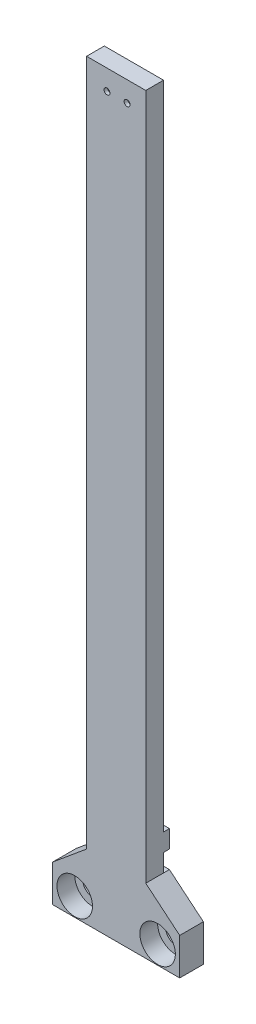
from build123d import *

# Parameters (mm, degrees)
CROQUIS1_W              = 10
CROQUIS1_H              = 125
SALIENTE_EXTRUIR1_DEPTH = 3
CROQUIS2_W              = 10
CROQUIS2_H              = 9
CROQUIS2_H_2            = 3
SALIENTE_EXTRUIR2_DEPTH = 1
CORTAR_EXTRUIR1_DEPTH   = 2.4
CROQUIS4_R              = 0.5
CORTAR_EXTRUIR2_DEPTH   = 4
SALIENTE_EXTRUIR3_DEPTH = 4
CROQUIS9_W              = 21.4673268
CROQUIS9_H              = 2
SALIENTE_EXTRUIR4_DEPTH = 4
CROQUIS7_R              = 3
CORTAR_EXTRUIR4_DEPTH   = 3
CROQUIS8_R              = 1.625
CORTAR_EXTRUIR5_DEPTH   = 6


with BuildPart() as part:
    # Croquis1 → Saliente-Extruir1 (new body)
    with BuildSketch(Plane.XY):
        with Locations((0, -52.820689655)):
            Rectangle(CROQUIS1_W, CROQUIS1_H)
    extrude(amount=SALIENTE_EXTRUIR1_DEPTH)

    # Croquis2 → Saliente-Extruir2 (add)
    with BuildSketch(Plane(origin=(0, 0, 0), x_dir=(-1, 0, 0), z_dir=(0, 0, -1))):
        with Locations((0, -110.820689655)):
            Rectangle(CROQUIS2_W, CROQUIS2_H)
        with Locations((0, -101.820689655)):
            Rectangle(CROQUIS2_W, CROQUIS2_H_2)
    extrude(amount=SALIENTE_EXTRUIR2_DEPTH)

    # Croquis3 → Cortar-Extruir1 (cut)
    with BuildSketch(Plane(origin=(0, 0, 0), x_dir=(-1, 0, 0), z_dir=(0, 0, -1))):
        with BuildLine():
            Line((-1.32947358, 8.599830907), (1.32947358, 8.599830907))
            ThreePointArc((1.32947358, 8.599830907), (2.7, 6.249830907), (1.32947358, 3.899830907))
            Line((1.32947358, 3.899830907), (-1.32947358, 3.899830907))
            ThreePointArc((-1.32947358, 3.899830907), (-2.7, 6.249830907), (-1.32947358, 8.599830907))
        make_face()
    extrude(amount=-CORTAR_EXTRUIR1_DEPTH, mode=Mode.SUBTRACT)

    # Croquis4 → Cortar-Extruir2 (cut)
    with BuildSketch(Plane(origin=(0, 0, 2.4), x_dir=(-1, 0, 0), z_dir=(0, 0, -1))):
        with Locations((-1.85, 6.249830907)):
            Circle(CROQUIS4_R)
        with Locations((1.55, 6.249830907)):
            Circle(CROQUIS4_R)
    extrude(amount=-CORTAR_EXTRUIR2_DEPTH, mode=Mode.SUBTRACT)

    # Croquis6 → Saliente-Extruir3 (add)
    with BuildSketch(Plane.XY.offset(3)):
        Polygon((5, -106.320689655), (10.7336634, -111.088486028), (10.7336634, -117.088486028), (5, -117.088486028), align=None)
        Polygon((-5, -117.088486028), (-5, -106.320689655), (-10.7336634, -111.088486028), (-10.7336634, -117.088486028), align=None)
    extrude(amount=-SALIENTE_EXTRUIR3_DEPTH)

    # Croquis9 → Saliente-Extruir4 (add)
    with BuildSketch(Plane.XY.offset(3)):
        with Locations((0, -116.320689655)):
            Rectangle(CROQUIS9_W, CROQUIS9_H)
    extrude(amount=-SALIENTE_EXTRUIR4_DEPTH)

    # Croquis7 → Cortar-Extruir4 (cut)
    with BuildSketch(Plane.XY.offset(3)):
        with Locations((7, -114.204587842)):
            Circle(CROQUIS7_R)
        with Locations((-7, -114.204587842)):
            Circle(CROQUIS7_R)
    extrude(amount=-CORTAR_EXTRUIR4_DEPTH, mode=Mode.SUBTRACT)

    # Croquis8 → Cortar-Extruir5 (cut)
    with BuildSketch(Plane.XY):
        with Locations((7, -114.204587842)):
            Circle(CROQUIS8_R)
        with Locations((-7, -114.204587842)):
            Circle(CROQUIS8_R)
    extrude(amount=-CORTAR_EXTRUIR5_DEPTH, mode=Mode.SUBTRACT)


solid = part.part
